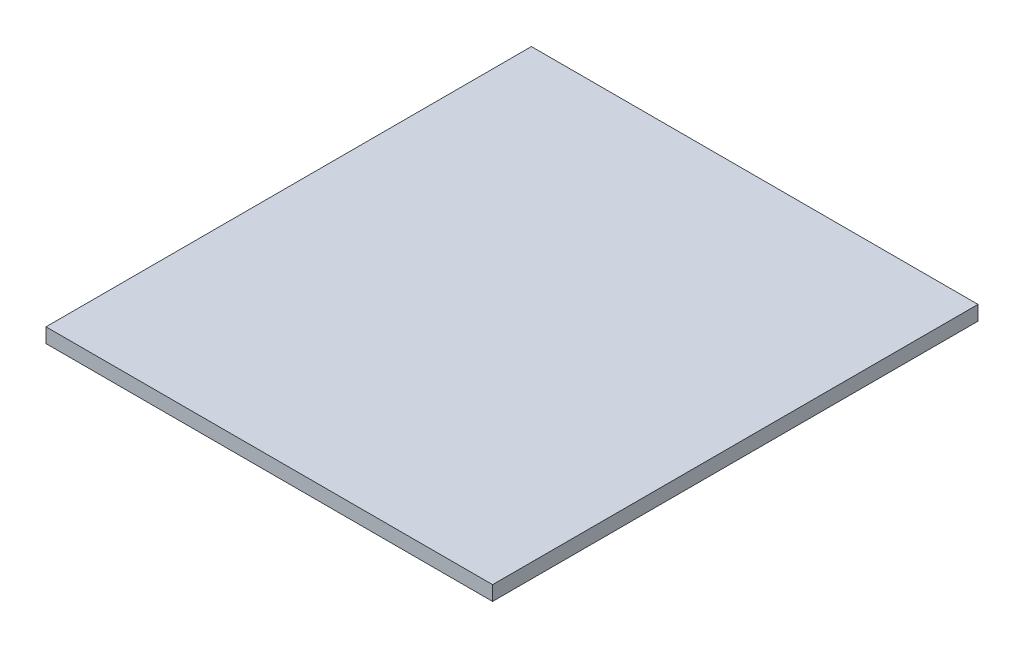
from build123d import *

# Parameters (mm, degrees)
SKETCH1_W           = 92
SKETCH1_H           = 100
BOSS_EXTRUDE1_DEPTH = 3


with BuildPart() as part:
    # Sketch1 → Boss-Extrude1 (new body)
    with BuildSketch(Plane(origin=(0, 0, 0), x_dir=(1, 0, 0), z_dir=(0, 1, 0))):
        Rectangle(SKETCH1_W, SKETCH1_H)
    extrude(amount=BOSS_EXTRUDE1_DEPTH)


solid = part.part
